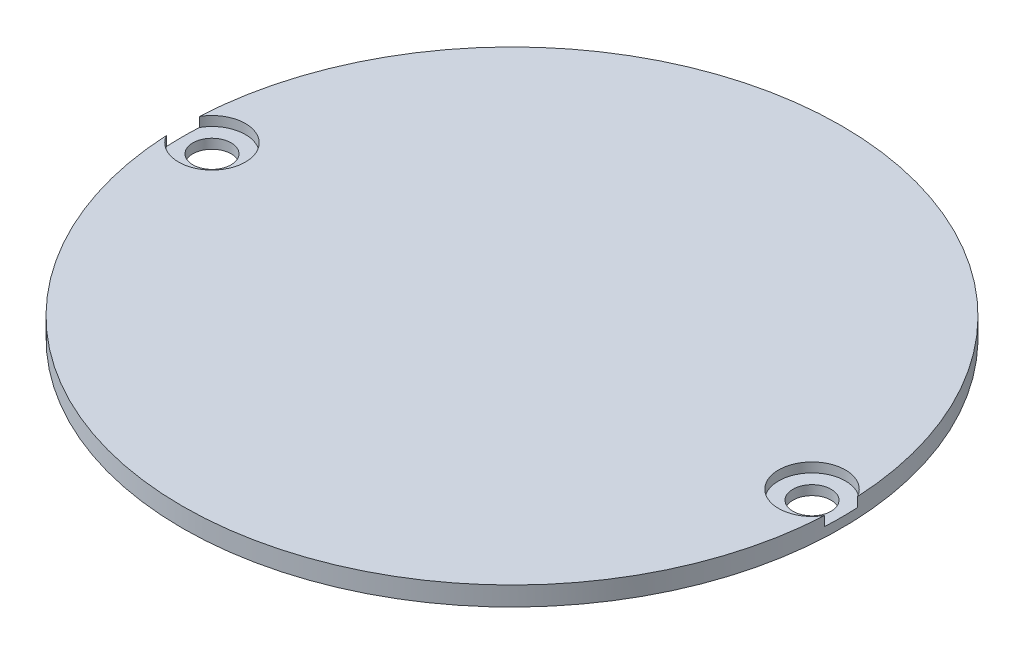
ISO-10303-21;
HEADER;
FILE_DESCRIPTION(('STEP AP214'),'2;1');
FILE_NAME('part.step','',(''),(''),'','','');
FILE_SCHEMA(('AUTOMOTIVE_DESIGN { 1 0 10303 214 1 1 1 1 }'));
ENDSEC;
DATA;
#1=APPLICATION_CONTEXT('core data for automotive mechanical design processes');
#2=APPLICATION_PROTOCOL_DEFINITION('international standard','automotive_design',2000,#1);
#3=PRODUCT_CONTEXT('',#1,'mechanical');
#4=PRODUCT('Part','Part','',(#3));
#5=PRODUCT_RELATED_PRODUCT_CATEGORY('part','',(#4));
#6=PRODUCT_DEFINITION_FORMATION('','',#4);
#7=PRODUCT_DEFINITION_CONTEXT('part definition',#1,'design');
#8=PRODUCT_DEFINITION('design','',#6,#7);
#9=PRODUCT_DEFINITION_SHAPE('','',#8);
#10=(LENGTH_UNIT() NAMED_UNIT(*) SI_UNIT(.MILLI.,.METRE.));
#11=(NAMED_UNIT(*) PLANE_ANGLE_UNIT() SI_UNIT($,.RADIAN.));
#12=(NAMED_UNIT(*) SI_UNIT($,.STERADIAN.) SOLID_ANGLE_UNIT());
#13=UNCERTAINTY_MEASURE_WITH_UNIT(LENGTH_MEASURE(1.E-05),#10,'distance_accuracy_value','');
#14=(GEOMETRIC_REPRESENTATION_CONTEXT(3) GLOBAL_UNCERTAINTY_ASSIGNED_CONTEXT((#13)) GLOBAL_UNIT_ASSIGNED_CONTEXT((#10,
#11,#12)) REPRESENTATION_CONTEXT('',''));
#15=CARTESIAN_POINT('',(0.,0.,0.));
#16=DIRECTION('',(0.,0.,1.));
#17=DIRECTION('',(1.,0.,0.));
#18=AXIS2_PLACEMENT_3D('',#15,#16,#17);
#19=CARTESIAN_POINT('',(-31.41,-8.,0.));
#20=DIRECTION('',(0.,1.,0.));
#21=DIRECTION('',(0.,0.,1.));
#22=AXIS2_PLACEMENT_3D('',#19,#20,#21);
#23=CYLINDRICAL_SURFACE('',#22,2.);
#24=CARTESIAN_POINT('',(-31.41,0.,0.));
#25=DIRECTION('',(0.,-1.,0.));
#26=DIRECTION('',(0.,0.,-1.));
#27=AXIS2_PLACEMENT_3D('',#24,#25,#26);
#28=CIRCLE('',#27,2.);
#29=CARTESIAN_POINT('',(-31.41,0.,-2.));
#30=VERTEX_POINT('',#29);
#31=EDGE_CURVE('E101',#30,#30,#28,.T.);
#32=ORIENTED_EDGE('',*,*,#31,.T.);
#33=EDGE_LOOP('',(#32));
#34=FACE_BOUND('',#33,.T.);
#35=CARTESIAN_POINT('',(-31.41,0.999999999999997,0.));
#36=DIRECTION('',(0.,1.,0.));
#37=DIRECTION('',(0.,0.,1.));
#38=AXIS2_PLACEMENT_3D('',#35,#36,#37);
#39=CIRCLE('',#38,2.);
#40=CARTESIAN_POINT('',(-31.41,0.999999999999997,2.00000000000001));
#41=VERTEX_POINT('',#40);
#42=EDGE_CURVE('E120',#41,#41,#39,.F.);
#43=ORIENTED_EDGE('',*,*,#42,.F.);
#44=EDGE_LOOP('',(#43));
#45=FACE_BOUND('',#44,.T.);
#46=ADVANCED_FACE('F39',(#34,#45),#23,.F.);
#47=CARTESIAN_POINT('',(0.,2.,0.));
#48=DIRECTION('',(0.,-1.,0.));
#49=DIRECTION('',(0.,0.,-1.));
#50=AXIS2_PLACEMENT_3D('',#47,#48,#49);
#51=PLANE('',#50);
#52=CARTESIAN_POINT('',(0.,2.,0.));
#53=DIRECTION('',(0.,-1.,0.));
#54=DIRECTION('',(0.,0.,-1.));
#55=AXIS2_PLACEMENT_3D('',#52,#53,#54);
#56=CIRCLE('',#55,34.5);
#57=CARTESIAN_POINT('',(-34.4569898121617,2.,-1.72216523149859));
#58=VERTEX_POINT('',#57);
#59=CARTESIAN_POINT('',(34.4569898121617,2.,-1.72216523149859));
#60=VERTEX_POINT('',#59);
#61=EDGE_CURVE('E95',#58,#60,#56,.T.);
#62=ORIENTED_EDGE('',*,*,#61,.F.);
#63=CARTESIAN_POINT('',(-31.41,2.,0.));
#64=DIRECTION('',(0.,1.,0.));
#65=DIRECTION('',(0.,0.,1.));
#66=AXIS2_PLACEMENT_3D('',#63,#64,#65);
#67=CIRCLE('',#66,3.5);
#68=CARTESIAN_POINT('',(-34.4569898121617,2.,1.7221652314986));
#69=VERTEX_POINT('',#68);
#70=EDGE_CURVE('E79',#69,#58,#67,.T.);
#71=ORIENTED_EDGE('',*,*,#70,.F.);
#72=CARTESIAN_POINT('',(34.4569898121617,2.,1.7221652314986));
#73=VERTEX_POINT('',#72);
#74=EDGE_CURVE('E100',#73,#69,#56,.T.);
#75=ORIENTED_EDGE('',*,*,#74,.F.);
#76=CARTESIAN_POINT('',(31.41,2.,0.));
#77=DIRECTION('',(0.,1.,0.));
#78=DIRECTION('',(0.,0.,-1.));
#79=AXIS2_PLACEMENT_3D('',#76,#77,#78);
#80=CIRCLE('',#79,3.5);
#81=EDGE_CURVE('E98',#60,#73,#80,.T.);
#82=ORIENTED_EDGE('',*,*,#81,.F.);
#83=EDGE_LOOP('',(#62,#71,#75,#82));
#84=FACE_BOUND('',#83,.T.);
#85=ADVANCED_FACE('F41',(#84),#51,.F.);
#86=CARTESIAN_POINT('',(0.,0.,0.));
#87=DIRECTION('',(0.,-1.,0.));
#88=DIRECTION('',(0.,0.,-1.));
#89=AXIS2_PLACEMENT_3D('',#86,#87,#88);
#90=PLANE('',#89);
#91=ORIENTED_EDGE('',*,*,#31,.F.);
#92=EDGE_LOOP('',(#91));
#93=FACE_BOUND('',#92,.T.);
#94=CARTESIAN_POINT('',(31.41,0.,0.));
#95=DIRECTION('',(0.,-1.,0.));
#96=DIRECTION('',(0.,0.,-1.));
#97=AXIS2_PLACEMENT_3D('',#94,#95,#96);
#98=CIRCLE('',#97,2.);
#99=CARTESIAN_POINT('',(31.41,0.,-2.));
#100=VERTEX_POINT('',#99);
#101=EDGE_CURVE('E107',#100,#100,#98,.T.);
#102=ORIENTED_EDGE('',*,*,#101,.F.);
#103=EDGE_LOOP('',(#102));
#104=FACE_BOUND('',#103,.T.);
#105=CARTESIAN_POINT('',(0.,0.,0.));
#106=DIRECTION('',(0.,-1.,0.));
#107=DIRECTION('',(0.,0.,-1.));
#108=AXIS2_PLACEMENT_3D('',#105,#106,#107);
#109=CIRCLE('',#108,34.5);
#110=CARTESIAN_POINT('',(0.,0.,-34.5));
#111=VERTEX_POINT('',#110);
#112=EDGE_CURVE('E105',#111,#111,#109,.T.);
#113=ORIENTED_EDGE('',*,*,#112,.T.);
#114=EDGE_LOOP('',(#113));
#115=FACE_BOUND('',#114,.T.);
#116=ADVANCED_FACE('F158',(#93,#104,#115),#90,.T.);
#117=CARTESIAN_POINT('',(0.,0.,0.));
#118=DIRECTION('',(0.,-1.,0.));
#119=DIRECTION('',(0.,0.,-1.));
#120=AXIS2_PLACEMENT_3D('',#117,#118,#119);
#121=CYLINDRICAL_SURFACE('',#120,34.5);
#122=DIRECTION('',(0.,1.,0.));
#123=VECTOR('',#122,1.);
#124=CARTESIAN_POINT('',(-34.4569898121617,1.5,-1.72216523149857));
#125=LINE('',#124,#123);
#126=CARTESIAN_POINT('',(-34.4569898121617,0.999999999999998,-1.72216523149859));
#127=VERTEX_POINT('',#126);
#128=EDGE_CURVE('E11',#58,#127,#125,.F.);
#129=ORIENTED_EDGE('',*,*,#128,.F.);
#130=ORIENTED_EDGE('',*,*,#61,.T.);
#131=DIRECTION('',(0.,1.,0.));
#132=VECTOR('',#131,1.);
#133=CARTESIAN_POINT('',(34.4569898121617,1.5,-1.72216523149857));
#134=LINE('',#133,#132);
#135=CARTESIAN_POINT('',(34.4569898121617,0.999999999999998,-1.72216523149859));
#136=VERTEX_POINT('',#135);
#137=EDGE_CURVE('E116',#136,#60,#134,.T.);
#138=ORIENTED_EDGE('',*,*,#137,.F.);
#139=CARTESIAN_POINT('',(0.,0.999999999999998,0.));
#140=DIRECTION('',(0.,-1.,0.));
#141=DIRECTION('',(0.,0.,-1.));
#142=AXIS2_PLACEMENT_3D('',#139,#140,#141);
#143=CIRCLE('',#142,34.5);
#144=CARTESIAN_POINT('',(34.4569898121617,0.999999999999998,1.7221652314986));
#145=VERTEX_POINT('',#144);
#146=EDGE_CURVE('E111',#145,#136,#143,.F.);
#147=ORIENTED_EDGE('',*,*,#146,.F.);
#148=DIRECTION('',(0.,1.,0.));
#149=VECTOR('',#148,1.);
#150=CARTESIAN_POINT('',(34.4569898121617,1.5,1.72216523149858));
#151=LINE('',#150,#149);
#152=EDGE_CURVE('E130',#73,#145,#151,.F.);
#153=ORIENTED_EDGE('',*,*,#152,.F.);
#154=ORIENTED_EDGE('',*,*,#74,.T.);
#155=DIRECTION('',(0.,1.,0.));
#156=VECTOR('',#155,1.);
#157=CARTESIAN_POINT('',(-34.4569898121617,1.5,1.72216523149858));
#158=LINE('',#157,#156);
#159=CARTESIAN_POINT('',(-34.4569898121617,0.999999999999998,1.7221652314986));
#160=VERTEX_POINT('',#159);
#161=EDGE_CURVE('E48',#160,#69,#158,.T.);
#162=ORIENTED_EDGE('',*,*,#161,.F.);
#163=CARTESIAN_POINT('',(0.,0.999999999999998,0.));
#164=DIRECTION('',(0.,1.,0.));
#165=DIRECTION('',(0.,0.,1.));
#166=AXIS2_PLACEMENT_3D('',#163,#164,#165);
#167=CIRCLE('',#166,34.5);
#168=EDGE_CURVE('E96',#160,#127,#167,.F.);
#169=ORIENTED_EDGE('',*,*,#168,.T.);
#170=EDGE_LOOP('',(#129,#130,#138,#147,#153,#154,#162,#169));
#171=FACE_BOUND('',#170,.T.);
#172=ORIENTED_EDGE('',*,*,#112,.F.);
#173=EDGE_LOOP('',(#172));
#174=FACE_BOUND('',#173,.T.);
#175=ADVANCED_FACE('F92',(#171,#174),#121,.T.);
#176=CARTESIAN_POINT('',(31.41,-8.,0.));
#177=DIRECTION('',(0.,1.,0.));
#178=DIRECTION('',(0.,0.,1.));
#179=AXIS2_PLACEMENT_3D('',#176,#177,#178);
#180=CYLINDRICAL_SURFACE('',#179,2.);
#181=CARTESIAN_POINT('',(31.41,0.999999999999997,0.));
#182=DIRECTION('',(0.,-1.,0.));
#183=DIRECTION('',(0.,0.,-1.));
#184=AXIS2_PLACEMENT_3D('',#181,#182,#183);
#185=CIRCLE('',#184,2.);
#186=CARTESIAN_POINT('',(31.41,0.999999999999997,-2.));
#187=VERTEX_POINT('',#186);
#188=EDGE_CURVE('E124',#187,#187,#185,.F.);
#189=ORIENTED_EDGE('',*,*,#188,.T.);
#190=EDGE_LOOP('',(#189));
#191=FACE_BOUND('',#190,.T.);
#192=ORIENTED_EDGE('',*,*,#101,.T.);
#193=EDGE_LOOP('',(#192));
#194=FACE_BOUND('',#193,.T.);
#195=ADVANCED_FACE('F151',(#191,#194),#180,.F.);
#196=CARTESIAN_POINT('',(-31.41,0.999999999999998,0.));
#197=DIRECTION('',(0.,1.,0.));
#198=DIRECTION('',(0.,0.,1.));
#199=AXIS2_PLACEMENT_3D('',#196,#197,#198);
#200=PLANE('',#199);
#201=CARTESIAN_POINT('',(-31.41,0.999999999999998,0.));
#202=DIRECTION('',(0.,1.,0.));
#203=DIRECTION('',(0.,0.,1.));
#204=AXIS2_PLACEMENT_3D('',#201,#202,#203);
#205=CIRCLE('',#204,3.5);
#206=EDGE_CURVE('E54',#160,#127,#205,.T.);
#207=ORIENTED_EDGE('',*,*,#206,.T.);
#208=ORIENTED_EDGE('',*,*,#168,.F.);
#209=EDGE_LOOP('',(#207,#208));
#210=FACE_BOUND('',#209,.T.);
#211=ORIENTED_EDGE('',*,*,#42,.T.);
#212=EDGE_LOOP('',(#211));
#213=FACE_BOUND('',#212,.T.);
#214=ADVANCED_FACE('F154',(#210,#213),#200,.T.);
#215=CARTESIAN_POINT('',(-31.41,0.999999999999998,0.));
#216=DIRECTION('',(0.,1.,0.));
#217=DIRECTION('',(0.,0.,1.));
#218=AXIS2_PLACEMENT_3D('',#215,#216,#217);
#219=CYLINDRICAL_SURFACE('',#218,3.5);
#220=ORIENTED_EDGE('',*,*,#128,.T.);
#221=ORIENTED_EDGE('',*,*,#206,.F.);
#222=ORIENTED_EDGE('',*,*,#161,.T.);
#223=ORIENTED_EDGE('',*,*,#70,.T.);
#224=EDGE_LOOP('',(#220,#221,#222,#223));
#225=FACE_BOUND('',#224,.T.);
#226=ADVANCED_FACE('F81',(#225),#219,.F.);
#227=CARTESIAN_POINT('',(31.41,0.999999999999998,0.));
#228=DIRECTION('',(0.,-1.,0.));
#229=DIRECTION('',(0.,0.,-1.));
#230=AXIS2_PLACEMENT_3D('',#227,#228,#229);
#231=PLANE('',#230);
#232=ORIENTED_EDGE('',*,*,#146,.T.);
#233=CARTESIAN_POINT('',(31.41,0.999999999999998,0.));
#234=DIRECTION('',(0.,1.,0.));
#235=DIRECTION('',(0.,0.,-1.));
#236=AXIS2_PLACEMENT_3D('',#233,#234,#235);
#237=CIRCLE('',#236,3.5);
#238=EDGE_CURVE('E60',#136,#145,#237,.T.);
#239=ORIENTED_EDGE('',*,*,#238,.T.);
#240=EDGE_LOOP('',(#232,#239));
#241=FACE_BOUND('',#240,.T.);
#242=ORIENTED_EDGE('',*,*,#188,.F.);
#243=EDGE_LOOP('',(#242));
#244=FACE_BOUND('',#243,.T.);
#245=ADVANCED_FACE('F145',(#241,#244),#231,.F.);
#246=CARTESIAN_POINT('',(31.41,0.999999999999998,0.));
#247=DIRECTION('',(0.,1.,0.));
#248=DIRECTION('',(0.,0.,1.));
#249=AXIS2_PLACEMENT_3D('',#246,#247,#248);
#250=CYLINDRICAL_SURFACE('',#249,3.5);
#251=ORIENTED_EDGE('',*,*,#152,.T.);
#252=ORIENTED_EDGE('',*,*,#238,.F.);
#253=ORIENTED_EDGE('',*,*,#137,.T.);
#254=ORIENTED_EDGE('',*,*,#81,.T.);
#255=EDGE_LOOP('',(#251,#252,#253,#254));
#256=FACE_BOUND('',#255,.T.);
#257=ADVANCED_FACE('F136',(#256),#250,.F.);
#258=CLOSED_SHELL('',(#46,#85,#116,#175,#195,#214,#226,#245,#257));
#259=MANIFOLD_SOLID_BREP('B2',#258);
#260=ADVANCED_BREP_SHAPE_REPRESENTATION('',(#18,#259),#14);
#261=SHAPE_DEFINITION_REPRESENTATION(#9,#260);
ENDSEC;
END-ISO-10303-21;
